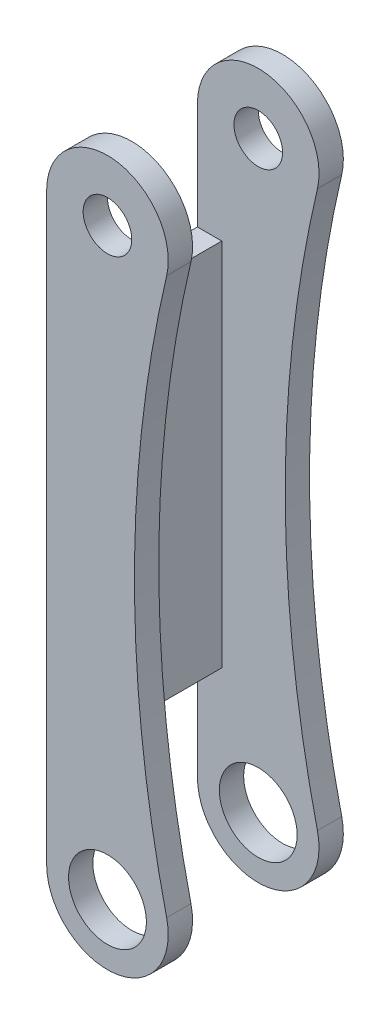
from build123d import *

# Parameters (mm, degrees)
SKETCH1_R           = 8
SKETCH1_R_2         = 5
BOSS_EXTRUDE1_DEPTH = 36
SKETCH4_W           = 196.923679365
SKETCH4_H           = 26
CUT_EXTRUDE1_DEPTH  = 140.560918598
SKETCH6_W           = 26
SKETCH6_H           = 76
BOSS_EXTRUDE2_DEPTH = 5


with BuildPart() as part:
    # Sketch1 → Boss-Extrude1 (new body)
    with BuildSketch(Plane.XY):
        with BuildLine():
            Line((-12.5, 120), (-12.5, 0))
            ThreePointArc((-12.5, 0), (1.438120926, -12.416996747), (12.169089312, 2.857142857))
            ThreePointArc((12.169089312, 2.857142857), (5.550875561, 60), (12.169089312, 117.142857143))
            ThreePointArc((12.169089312, 117.142857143), (1.438120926, 132.416996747), (-12.5, 120))
        make_face()
        with Locations(Location((0, 0, 0), (0, 0, 180))):
            Circle(SKETCH1_R, mode=Mode.SUBTRACT)
        with Locations(Location((0, 120, 0), (0, 0, 180))):
            Circle(SKETCH1_R_2, mode=Mode.SUBTRACT)
    extrude(amount=BOSS_EXTRUDE1_DEPTH)

    # Sketch4 → Cut-Extrude1 (cut, through all)
    with BuildSketch(Plane(origin=(-12.5, 0, 0), x_dir=(0, -1, 0), z_dir=(1, 0, 0))):
        with Locations((-65.93367666, -18)):
            Rectangle(SKETCH4_W, SKETCH4_H)
    extrude(amount=CUT_EXTRUDE1_DEPTH, mode=Mode.SUBTRACT)


with BuildPart() as cut_extrude1_piece_1:
    # of the separate pieces the step leaves, piece 1, a body of its own (cut_extrude1_pieces)
    add(part.part.solids().sort_by_distance((-12.5, 120, 31))[0])



with BuildPart() as cut_extrude1_piece_2:
    # of the separate pieces the step leaves, piece 2, a body of its own (cut_extrude1_pieces)
    add(part.part.solids().sort_by_distance((12.169089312, 117.142857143, 0))[0])


with BuildPart() as cut_extrude1_piece_1_1:
    add(cut_extrude1_piece_1.part)

    add(cut_extrude1_piece_2.part)  # Boss-Extrude2 merges Cut-Extrude1 piece 2
    # Sketch6 → Boss-Extrude2 (add)
    with BuildSketch(Plane.ZY.offset(12.5)):
        with Locations((18, 60)):
            Rectangle(SKETCH6_W, SKETCH6_H)
    extrude(amount=-BOSS_EXTRUDE2_DEPTH)


solid = cut_extrude1_piece_1_1.part
